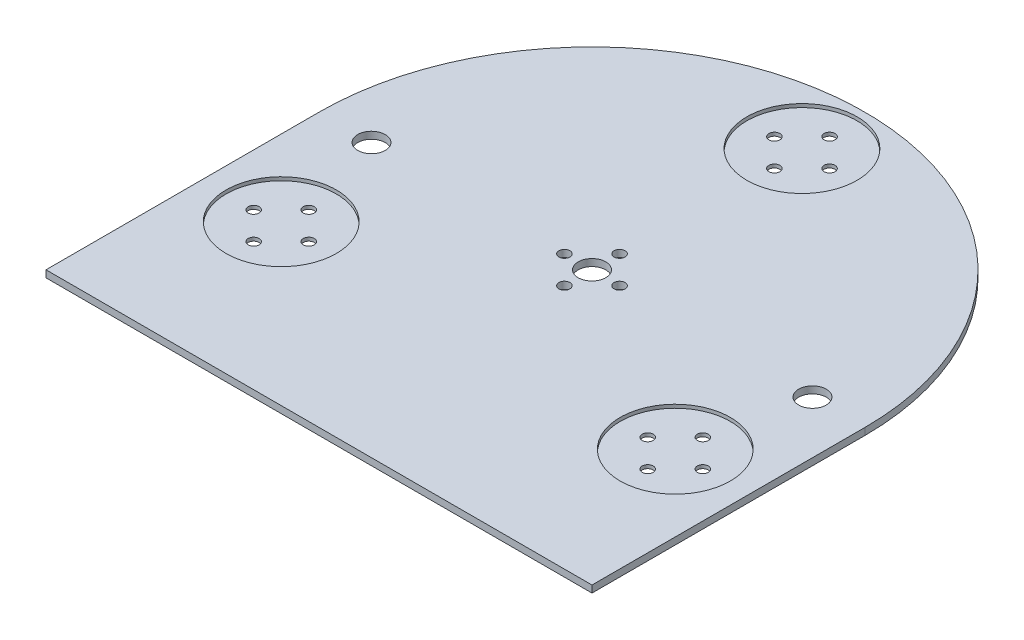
from build123d import *

# Parameters (mm, degrees)
BOSS_EXTRUDE1_DEPTH     = 2.54
SKETCH2_R               = 20
SKETCH2_R_2             = 2.5
SKETCH2_R_3             = 5
CUT_EXTRUDE1_DEPTH      = 1.27
CUT_EXTRUDE2_DEPTH      = 141.097751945
CUT_EXTRUDE2_DEPTH_BACK = 141.097751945
SKETCH3_R               = 2
SKETCH3_R_2             = 5


with BuildPart() as part:
    # Sketch1 → Boss-Extrude1 (new body)
    with BuildSketch(Plane(origin=(0, 0, 0), x_dir=(1, 0, 0), z_dir=(0, 1, 0))):
        with BuildLine():
            ThreePointArc((99.06, 0), (0, 99.06), (-99.06, 0))
            Line((-99.06, 0), (99.06, 0))
        make_face()
        with BuildLine():
            Line((99.06, 0), (-99.06, 0))
            ThreePointArc((-99.06, 0), (-70.045997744, -70.045997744), (0, -99.06))
            ThreePointArc((0, -99.06), (70.045997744, -70.045997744), (99.06, 0))
        make_face()
        with BuildLine():
            ThreePointArc((99.06, 0), (0, 99.06), (-99.06, 0))
            Line((-99.06, 0), (99.06, 0))
        make_face()
        with BuildLine():
            Line((99.06, 0), (-99.06, 0))
            ThreePointArc((-99.06, 0), (-70.045997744, -70.045997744), (0, -99.06))
            ThreePointArc((0, -99.06), (70.045997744, -70.045997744), (99.06, 0))
        make_face()
        with BuildLine():
            ThreePointArc((0, -99.06), (-70.045997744, -70.045997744), (-99.06, 0))
            Line((-99.06, 0), (-99.06, -99.06))
            Line((-99.06, -99.06), (0, -99.06))
        make_face()
        with BuildLine():
            Line((99.06, -99.06), (99.06, 0))
            ThreePointArc((99.06, 0), (70.045997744, -70.045997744), (0, -99.06))
            Line((0, -99.06), (99.06, -99.06))
        make_face()
    extrude(amount=BOSS_EXTRUDE1_DEPTH)

    # Sketch2 → Cut-Extrude1 (cut)
    with BuildSketch(Plane(origin=(0, 2.54, 0), x_dir=(1, 0, 0), z_dir=(0, 1, 0))):
        with Locations(Location((-71.490397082, -41.275, 0), (0, 0, 270))):
            Circle(SKETCH2_R)
        with Locations(Location((71.490397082, -41.275, 0), (0, 0, 270))):
            Circle(SKETCH2_R)
        with Locations(Location((0, 76.2, 0), (0, 0, 270))):
            Circle(SKETCH2_R)
        with Locations(Location((0, 0, 0), (0, 0, 270))):
            Circle(SKETCH2_R_2)
        with Locations(Location((-80.01, 0, 0), (0, 0, 270))):
            Circle(SKETCH2_R_3)
        with Locations(Location((80.01, 0, 0), (0, 0, 90))):
            Circle(SKETCH2_R_3)
    extrude(amount=-CUT_EXTRUDE1_DEPTH, mode=Mode.SUBTRACT)

    # Sketch3 → Cut-Extrude2 (cut, two sides: drawn at the far end of the back side and taken through both)
    with BuildSketch(Plane(origin=(0, 1.27, 0), x_dir=(1, 0, 0), z_dir=(0, 1, 0)).offset(-CUT_EXTRUDE2_DEPTH_BACK)):
        with Locations(Location((-71.490397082, -31.275, 0), (0, 0, 270))):
            Circle(SKETCH3_R)
        with Locations(Location((0, 10, 0), (0, 0, 270))):
            Circle(SKETCH3_R)
        with Locations(Location((0, 66.2, 0), (0, 0, 270))):
            Circle(SKETCH3_R)
        with Locations(Location((71.490397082, -31.275, 0), (0, 0, 270))):
            Circle(SKETCH3_R)
        with Locations(Location((-61.490397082, -41.275, 0), (0, 0, 270))):
            Circle(SKETCH3_R)
        with Locations(Location((-71.490397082, -51.275, 0), (0, 0, 270))):
            Circle(SKETCH3_R)
        with Locations(Location((-81.490397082, -41.275, 0), (0, 0, 270))):
            Circle(SKETCH3_R)
        with Locations(Location((10, 0, 0), (0, 0, 270))):
            Circle(SKETCH3_R)
        with Locations(Location((0, -10, 0), (0, 0, 270))):
            Circle(SKETCH3_R)
        with Locations(Location((-10, 0, 0), (0, 0, 270))):
            Circle(SKETCH3_R)
        with Locations(Location((-10, 76.2, 0), (0, 0, 270))):
            Circle(SKETCH3_R)
        with Locations(Location((0, 86.2, 0), (0, 0, 270))):
            Circle(SKETCH3_R)
        with Locations(Location((10, 76.2, 0), (0, 0, 270))):
            Circle(SKETCH3_R)
        with Locations(Location((81.490397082, -41.275, 0), (0, 0, 270))):
            Circle(SKETCH3_R)
        with Locations(Location((71.490397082, -51.275, 0), (0, 0, 270))):
            Circle(SKETCH3_R)
        with Locations(Location((61.490397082, -41.275, 0), (0, 0, 270))):
            Circle(SKETCH3_R)
        with Locations(Location((0, 0, 0), (0, 0, 270))):
            Circle(SKETCH3_R_2)
        with Locations(Location((-80.01, 0, 0), (0, 0, 270))):
            Circle(SKETCH3_R_2)
        with Locations(Location((80.01, 0, 0), (0, 0, 270))):
            Circle(SKETCH3_R_2)
    extrude(amount=CUT_EXTRUDE2_DEPTH + CUT_EXTRUDE2_DEPTH_BACK, mode=Mode.SUBTRACT)


solid = part.part
